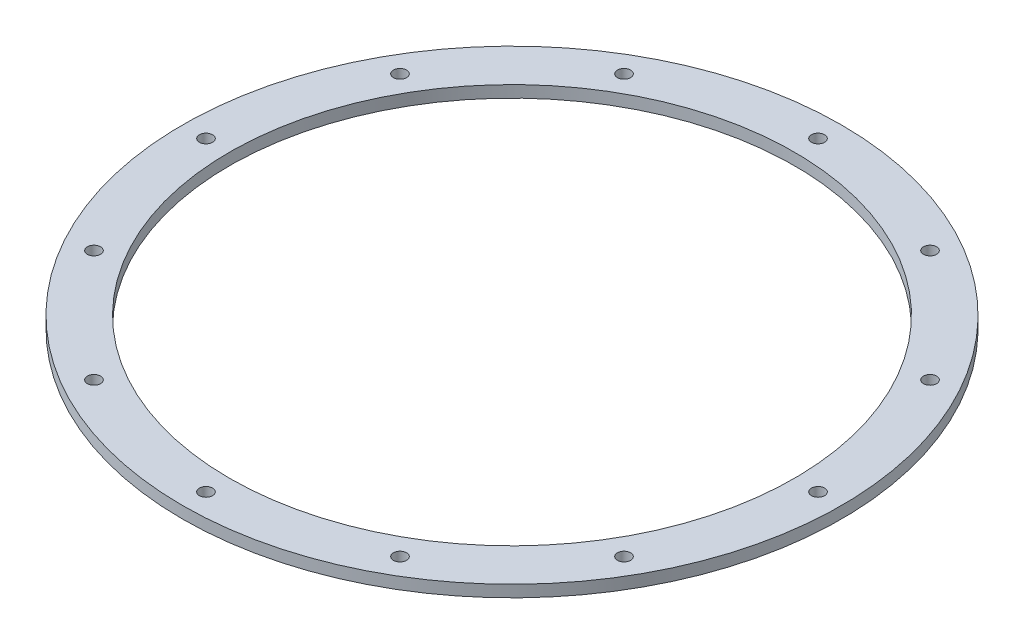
from build123d import *

# Parameters (mm, degrees)
SKETCH1_W                  = 6.35
SKETCH1_H                  = 1.5875
F_50_0_07_DIAMETER_HOLE1_D = 1.778
SCREW_PASSTHROUGHS_COUNT   = 12


with BuildPart() as part:
    # Sketch1 → Main (revolve)
    with BuildSketch(Plane.XY, mode=Mode.PRIVATE) as main_sk:
        with Locations((-41.275, 0.79375)):
            Rectangle(SKETCH1_W, SKETCH1_H)
    revolve(main_sk.sketch.rotate(Axis((0, 55, 0), (0, -1, 0)), 270), axis=Axis((0, 55, 0), (0, -1, 0)))

    # 50 _0.07_ Diameter Hole1 (through all)
    with Locations(Plane(origin=(0, 0, 0), x_dir=(-1, 0, 0), z_dir=(0, -1, 0))):
        with Locations((41.275, 0)):
            f_50_0_07_diameter_hole1 = Hole(F_50_0_07_DIAMETER_HOLE1_D / 2)

    # Screw Passthroughs: 50 _0.07_ Diameter Hole1 ×12 about axis
    screw_passthroughs_axis = Axis((0, 0, 0), (0, 1, 0))
    for i in range(1, SCREW_PASSTHROUGHS_COUNT):
        add(f_50_0_07_diameter_hole1.rotate(screw_passthroughs_axis, i * 360 / SCREW_PASSTHROUGHS_COUNT), mode=Mode.SUBTRACT)


solid = part.part
